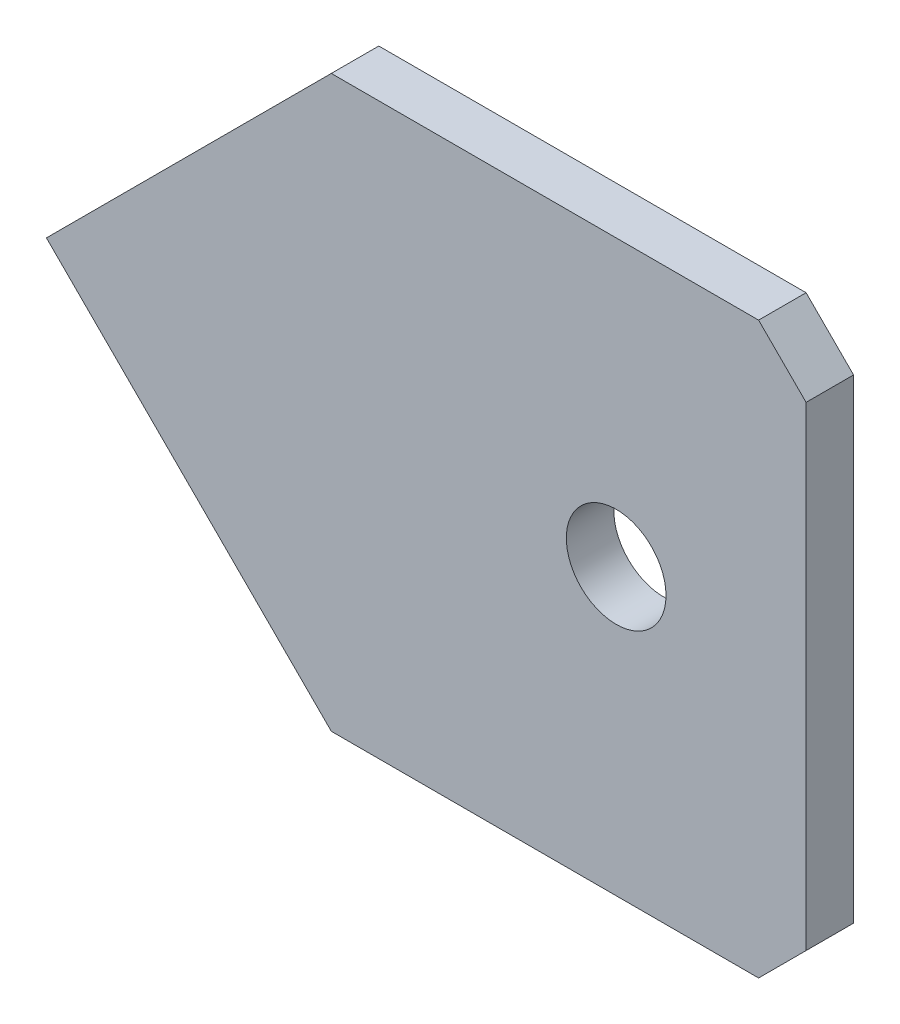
from build123d import *

# Parameters (mm, degrees)
SKICA1_W                          = 80
SKICA1_H                          = 60
EXTRUDE1_DEPTH                    = 5
HOLE_WIZARD_M10_5_10_500000_D     = 10.5
HOLE_WIZARD_M10_5_10_500000_DEPTH = 15
HOLE_WIZARD_M10_5_10_500000_TIP   = 3.15451825
ODEBRAT_VYSUNUT_M1_DEPTH          = 51.249378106
ODEBRAT_VYSUNUT_M1_DEPTH_BACK     = 51.249378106
ZKOSIT1_SIZE                      = 5


with BuildPart() as part:
    # Skica1 → Extrude1 (new body)
    with BuildSketch(Plane.XY):
        Rectangle(SKICA1_W, SKICA1_H)
    extrude(amount=EXTRUDE1_DEPTH)

    # Hole Wizard M10.5 _10.500000
    with Locations(Plane.XY.offset(5)):
        with Locations((20, 0)):
            Hole(HOLE_WIZARD_M10_5_10_500000_D / 2, depth=HOLE_WIZARD_M10_5_10_500000_DEPTH)
            with Locations((0, 0, -(HOLE_WIZARD_M10_5_10_500000_DEPTH + HOLE_WIZARD_M10_5_10_500000_TIP / 2))):  # 118° drill point
                Cone(0, HOLE_WIZARD_M10_5_10_500000_D / 2, HOLE_WIZARD_M10_5_10_500000_TIP, mode=Mode.SUBTRACT)

    # Skica4 → Odebrat vysunut_m1 (cut, two sides: drawn at the far end of the back side and taken through both)
    with BuildSketch(Plane.XY.offset(5).offset(-ODEBRAT_VYSUNUT_M1_DEPTH_BACK)):
        Polygon((107.524677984, 147.524677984), (-10, 30), (-40, 0), (-10, -30), (107.524677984, -147.524677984), (-224.885309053, -147.524677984), (-224.885309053, 147.524677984), align=None)
    extrude(amount=ODEBRAT_VYSUNUT_M1_DEPTH + ODEBRAT_VYSUNUT_M1_DEPTH_BACK, mode=Mode.SUBTRACT)

    # Zkosit1
    zkosit1_edges = [part.edges().sort_by_distance(p)[0] for p in [
        (40, 30, 2.5),
        (40, -30, 2.5),
    ]]
    chamfer(zkosit1_edges, length=ZKOSIT1_SIZE)


solid = part.part
